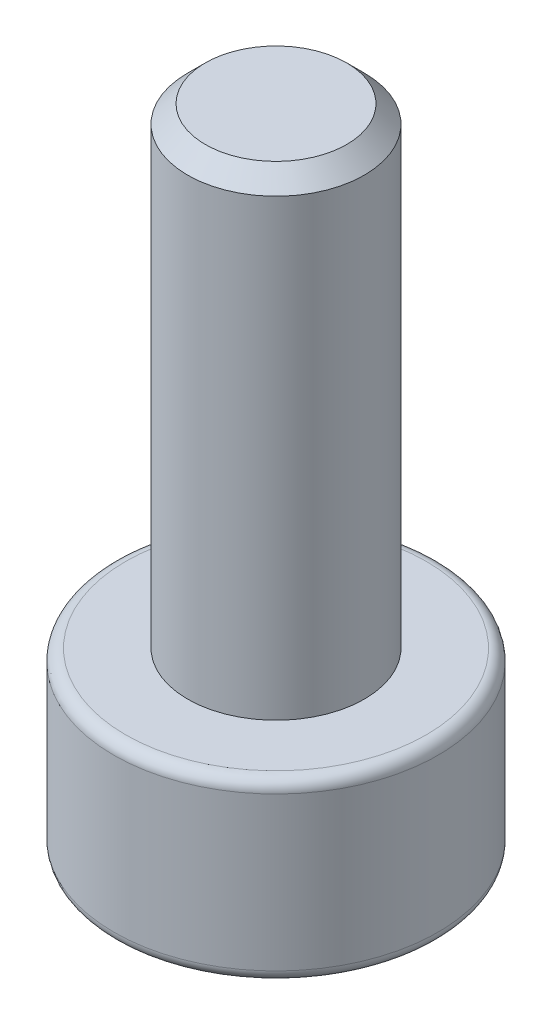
ISO-10303-21;
HEADER;
FILE_DESCRIPTION(('STEP AP214'),'2;1');
FILE_NAME('part.step','',(''),(''),'','','');
FILE_SCHEMA(('AUTOMOTIVE_DESIGN { 1 0 10303 214 1 1 1 1 }'));
ENDSEC;
DATA;
#1=APPLICATION_CONTEXT('core data for automotive mechanical design processes');
#2=APPLICATION_PROTOCOL_DEFINITION('international standard','automotive_design',2000,#1);
#3=PRODUCT_CONTEXT('',#1,'mechanical');
#4=PRODUCT('Part','Part','',(#3));
#5=PRODUCT_RELATED_PRODUCT_CATEGORY('part','',(#4));
#6=PRODUCT_DEFINITION_FORMATION('','',#4);
#7=PRODUCT_DEFINITION_CONTEXT('part definition',#1,'design');
#8=PRODUCT_DEFINITION('design','',#6,#7);
#9=PRODUCT_DEFINITION_SHAPE('','',#8);
#10=(LENGTH_UNIT() NAMED_UNIT(*) SI_UNIT(.MILLI.,.METRE.));
#11=(NAMED_UNIT(*) PLANE_ANGLE_UNIT() SI_UNIT($,.RADIAN.));
#12=(NAMED_UNIT(*) SI_UNIT($,.STERADIAN.) SOLID_ANGLE_UNIT());
#13=UNCERTAINTY_MEASURE_WITH_UNIT(LENGTH_MEASURE(1.E-05),#10,'distance_accuracy_value','');
#14=(GEOMETRIC_REPRESENTATION_CONTEXT(3) GLOBAL_UNCERTAINTY_ASSIGNED_CONTEXT((#13)) GLOBAL_UNIT_ASSIGNED_CONTEXT((#10,
#11,#12)) REPRESENTATION_CONTEXT('',''));
#15=CARTESIAN_POINT('',(0.,0.,0.));
#16=DIRECTION('',(0.,0.,1.));
#17=DIRECTION('',(1.,0.,0.));
#18=AXIS2_PLACEMENT_3D('',#15,#16,#17);
#19=CARTESIAN_POINT('',(-1.15470053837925,2.,0.));
#20=DIRECTION('',(-0.866025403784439,0.,-0.5));
#21=DIRECTION('',(-0.5,0.,0.866025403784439));
#22=AXIS2_PLACEMENT_3D('',#19,#20,#21);
#23=PLANE('',#22);
#24=DIRECTION('',(0.,1.,0.));
#25=VECTOR('',#24,1.);
#26=CARTESIAN_POINT('',(-0.577350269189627,2.,-1.));
#27=LINE('',#26,#25);
#28=CARTESIAN_POINT('',(-0.577350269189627,0.,-1.));
#29=VERTEX_POINT('',#28);
#30=CARTESIAN_POINT('',(-0.577350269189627,2.,-1.));
#31=VERTEX_POINT('',#30);
#32=EDGE_CURVE('E97',#29,#31,#27,.T.);
#33=ORIENTED_EDGE('',*,*,#32,.T.);
#34=DIRECTION('',(-0.5,0.,0.866025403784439));
#35=VECTOR('',#34,1.);
#36=CARTESIAN_POINT('',(-1.15470053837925,2.,0.));
#37=LINE('',#36,#35);
#38=CARTESIAN_POINT('',(-1.15470053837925,2.,0.));
#39=VERTEX_POINT('',#38);
#40=EDGE_CURVE('E86',#39,#31,#37,.F.);
#41=ORIENTED_EDGE('',*,*,#40,.F.);
#42=DIRECTION('',(0.,1.,0.));
#43=VECTOR('',#42,1.);
#44=CARTESIAN_POINT('',(-1.15470053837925,2.,0.));
#45=LINE('',#44,#43);
#46=CARTESIAN_POINT('',(-1.15470053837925,0.,0.));
#47=VERTEX_POINT('',#46);
#48=EDGE_CURVE('E106',#39,#47,#45,.F.);
#49=ORIENTED_EDGE('',*,*,#48,.T.);
#50=DIRECTION('',(-0.5,0.,0.866025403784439));
#51=VECTOR('',#50,1.);
#52=CARTESIAN_POINT('',(-1.15470053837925,0.,0.));
#53=LINE('',#52,#51);
#54=EDGE_CURVE('E81',#29,#47,#53,.T.);
#55=ORIENTED_EDGE('',*,*,#54,.F.);
#56=EDGE_LOOP('',(#33,#41,#49,#55));
#57=FACE_BOUND('',#56,.T.);
#58=ADVANCED_FACE('F17',(#57),#23,.F.);
#59=CARTESIAN_POINT('',(-0.577350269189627,2.,-1.));
#60=DIRECTION('',(0.,0.,-1.));
#61=DIRECTION('',(-1.,0.,0.));
#62=AXIS2_PLACEMENT_3D('',#59,#60,#61);
#63=PLANE('',#62);
#64=DIRECTION('',(0.,1.,0.));
#65=VECTOR('',#64,1.);
#66=CARTESIAN_POINT('',(0.577350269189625,2.,-1.));
#67=LINE('',#66,#65);
#68=CARTESIAN_POINT('',(0.577350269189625,0.,-1.));
#69=VERTEX_POINT('',#68);
#70=CARTESIAN_POINT('',(0.577350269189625,2.,-1.));
#71=VERTEX_POINT('',#70);
#72=EDGE_CURVE('E102',#69,#71,#67,.T.);
#73=ORIENTED_EDGE('',*,*,#72,.T.);
#74=DIRECTION('',(-1.,0.,0.));
#75=VECTOR('',#74,1.);
#76=CARTESIAN_POINT('',(-0.577350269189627,2.,-1.));
#77=LINE('',#76,#75);
#78=EDGE_CURVE('E90',#31,#71,#77,.F.);
#79=ORIENTED_EDGE('',*,*,#78,.F.);
#80=ORIENTED_EDGE('',*,*,#32,.F.);
#81=DIRECTION('',(-1.,0.,0.));
#82=VECTOR('',#81,1.);
#83=CARTESIAN_POINT('',(-0.577350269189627,0.,-1.));
#84=LINE('',#83,#82);
#85=EDGE_CURVE('E104',#69,#29,#84,.T.);
#86=ORIENTED_EDGE('',*,*,#85,.F.);
#87=EDGE_LOOP('',(#73,#79,#80,#86));
#88=FACE_BOUND('',#87,.T.);
#89=ADVANCED_FACE('F100',(#88),#63,.F.);
#90=CARTESIAN_POINT('',(-0.577350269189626,2.,1.));
#91=DIRECTION('',(-0.866025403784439,0.,0.5));
#92=DIRECTION('',(0.5,0.,0.866025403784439));
#93=AXIS2_PLACEMENT_3D('',#90,#91,#92);
#94=PLANE('',#93);
#95=ORIENTED_EDGE('',*,*,#48,.F.);
#96=DIRECTION('',(-0.5,0.,-0.866025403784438));
#97=VECTOR('',#96,1.);
#98=CARTESIAN_POINT('',(-0.577350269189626,2.,1.));
#99=LINE('',#98,#97);
#100=CARTESIAN_POINT('',(-0.577350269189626,2.,1.));
#101=VERTEX_POINT('',#100);
#102=EDGE_CURVE('E93',#101,#39,#99,.T.);
#103=ORIENTED_EDGE('',*,*,#102,.F.);
#104=DIRECTION('',(0.,1.,0.));
#105=VECTOR('',#104,1.);
#106=CARTESIAN_POINT('',(-0.577350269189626,2.,1.));
#107=LINE('',#106,#105);
#108=CARTESIAN_POINT('',(-0.577350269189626,0.,1.));
#109=VERTEX_POINT('',#108);
#110=EDGE_CURVE('E187',#101,#109,#107,.F.);
#111=ORIENTED_EDGE('',*,*,#110,.T.);
#112=DIRECTION('',(0.5,0.,0.866025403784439));
#113=VECTOR('',#112,1.);
#114=CARTESIAN_POINT('',(-0.577350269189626,0.,1.));
#115=LINE('',#114,#113);
#116=EDGE_CURVE('E199',#47,#109,#115,.T.);
#117=ORIENTED_EDGE('',*,*,#116,.F.);
#118=EDGE_LOOP('',(#95,#103,#111,#117));
#119=FACE_BOUND('',#118,.T.);
#120=ADVANCED_FACE('F202',(#119),#94,.F.);
#121=CARTESIAN_POINT('',(0.577350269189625,2.,-1.));
#122=DIRECTION('',(0.866025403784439,0.,-0.5));
#123=DIRECTION('',(-0.5,0.,-0.866025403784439));
#124=AXIS2_PLACEMENT_3D('',#121,#122,#123);
#125=PLANE('',#124);
#126=DIRECTION('',(0.,1.,0.));
#127=VECTOR('',#126,1.);
#128=CARTESIAN_POINT('',(1.15470053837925,2.,0.));
#129=LINE('',#128,#127);
#130=CARTESIAN_POINT('',(1.15470053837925,0.,0.));
#131=VERTEX_POINT('',#130);
#132=CARTESIAN_POINT('',(1.15470053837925,2.,0.));
#133=VERTEX_POINT('',#132);
#134=EDGE_CURVE('E183',#131,#133,#129,.T.);
#135=ORIENTED_EDGE('',*,*,#134,.T.);
#136=DIRECTION('',(0.5,0.,0.866025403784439));
#137=VECTOR('',#136,1.);
#138=CARTESIAN_POINT('',(0.577350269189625,2.,-1.));
#139=LINE('',#138,#137);
#140=EDGE_CURVE('E193',#71,#133,#139,.T.);
#141=ORIENTED_EDGE('',*,*,#140,.F.);
#142=ORIENTED_EDGE('',*,*,#72,.F.);
#143=DIRECTION('',(-0.5,0.,-0.866025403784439));
#144=VECTOR('',#143,1.);
#145=CARTESIAN_POINT('',(0.577350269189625,0.,-1.));
#146=LINE('',#145,#144);
#147=EDGE_CURVE('E195',#131,#69,#146,.T.);
#148=ORIENTED_EDGE('',*,*,#147,.F.);
#149=EDGE_LOOP('',(#135,#141,#142,#148));
#150=FACE_BOUND('',#149,.T.);
#151=ADVANCED_FACE('F210',(#150),#125,.F.);
#152=CARTESIAN_POINT('',(0.,2.,0.));
#153=DIRECTION('',(0.,-1.,0.));
#154=DIRECTION('',(0.,0.,-1.));
#155=AXIS2_PLACEMENT_3D('',#152,#153,#154);
#156=PLANE('',#155);
#157=ORIENTED_EDGE('',*,*,#40,.T.);
#158=ORIENTED_EDGE('',*,*,#78,.T.);
#159=ORIENTED_EDGE('',*,*,#140,.T.);
#160=DIRECTION('',(0.5,0.,-0.866025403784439));
#161=VECTOR('',#160,1.);
#162=CARTESIAN_POINT('',(1.15470053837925,2.,0.));
#163=LINE('',#162,#161);
#164=CARTESIAN_POINT('',(0.577350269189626,2.,1.));
#165=VERTEX_POINT('',#164);
#166=EDGE_CURVE('E181',#133,#165,#163,.F.);
#167=ORIENTED_EDGE('',*,*,#166,.T.);
#168=DIRECTION('',(1.,0.,0.));
#169=VECTOR('',#168,1.);
#170=CARTESIAN_POINT('',(0.577350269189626,2.,1.));
#171=LINE('',#170,#169);
#172=EDGE_CURVE('E190',#165,#101,#171,.F.);
#173=ORIENTED_EDGE('',*,*,#172,.T.);
#174=ORIENTED_EDGE('',*,*,#102,.T.);
#175=EDGE_LOOP('',(#157,#158,#159,#167,#173,#174));
#176=FACE_BOUND('',#175,.T.);
#177=ADVANCED_FACE('F87',(#176),#156,.T.);
#178=CARTESIAN_POINT('',(0.577350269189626,2.,1.));
#179=DIRECTION('',(0.,0.,1.));
#180=DIRECTION('',(1.,0.,0.));
#181=AXIS2_PLACEMENT_3D('',#178,#179,#180);
#182=PLANE('',#181);
#183=ORIENTED_EDGE('',*,*,#110,.F.);
#184=ORIENTED_EDGE('',*,*,#172,.F.);
#185=DIRECTION('',(0.,1.,0.));
#186=VECTOR('',#185,1.);
#187=CARTESIAN_POINT('',(0.577350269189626,2.,1.));
#188=LINE('',#187,#186);
#189=CARTESIAN_POINT('',(0.577350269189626,0.,1.));
#190=VERTEX_POINT('',#189);
#191=EDGE_CURVE('E172',#165,#190,#188,.F.);
#192=ORIENTED_EDGE('',*,*,#191,.T.);
#193=DIRECTION('',(1.,0.,0.));
#194=VECTOR('',#193,1.);
#195=CARTESIAN_POINT('',(0.577350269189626,0.,1.));
#196=LINE('',#195,#194);
#197=EDGE_CURVE('E185',#109,#190,#196,.T.);
#198=ORIENTED_EDGE('',*,*,#197,.F.);
#199=EDGE_LOOP('',(#183,#184,#192,#198));
#200=FACE_BOUND('',#199,.T.);
#201=ADVANCED_FACE('F217',(#200),#182,.F.);
#202=CARTESIAN_POINT('',(1.15470053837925,2.,0.));
#203=DIRECTION('',(0.866025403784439,0.,0.5));
#204=DIRECTION('',(0.5,0.,-0.866025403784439));
#205=AXIS2_PLACEMENT_3D('',#202,#203,#204);
#206=PLANE('',#205);
#207=ORIENTED_EDGE('',*,*,#191,.F.);
#208=ORIENTED_EDGE('',*,*,#166,.F.);
#209=ORIENTED_EDGE('',*,*,#134,.F.);
#210=DIRECTION('',(-0.5,0.,0.866025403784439));
#211=VECTOR('',#210,1.);
#212=CARTESIAN_POINT('',(1.15470053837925,0.,0.));
#213=LINE('',#212,#211);
#214=EDGE_CURVE('E180',#131,#190,#213,.T.);
#215=ORIENTED_EDGE('',*,*,#214,.T.);
#216=EDGE_LOOP('',(#207,#208,#209,#215));
#217=FACE_BOUND('',#216,.T.);
#218=ADVANCED_FACE('F215',(#217),#206,.F.);
#219=CARTESIAN_POINT('',(0.,0.,0.));
#220=DIRECTION('',(0.,1.,0.));
#221=DIRECTION('',(0.,0.,1.));
#222=AXIS2_PLACEMENT_3D('',#219,#220,#221);
#223=PLANE('',#222);
#224=CARTESIAN_POINT('',(0.,0.,0.));
#225=DIRECTION('',(0.,1.,0.));
#226=DIRECTION('',(0.,0.,1.));
#227=AXIS2_PLACEMENT_3D('',#224,#225,#226);
#228=CIRCLE('',#227,2.55);
#229=CARTESIAN_POINT('',(0.,0.,2.55));
#230=VERTEX_POINT('',#229);
#231=CARTESIAN_POINT('',(0.,0.,-2.55));
#232=VERTEX_POINT('',#231);
#233=EDGE_CURVE('E271',#230,#232,#228,.T.);
#234=ORIENTED_EDGE('',*,*,#233,.F.);
#235=CARTESIAN_POINT('',(0.,0.,0.));
#236=DIRECTION('',(0.,1.,0.));
#237=DIRECTION('',(0.,0.,-1.));
#238=AXIS2_PLACEMENT_3D('',#235,#236,#237);
#239=CIRCLE('',#238,2.55);
#240=EDGE_CURVE('E270',#232,#230,#239,.T.);
#241=ORIENTED_EDGE('',*,*,#240,.F.);
#242=EDGE_LOOP('',(#234,#241));
#243=FACE_BOUND('',#242,.T.);
#244=ORIENTED_EDGE('',*,*,#147,.T.);
#245=ORIENTED_EDGE('',*,*,#85,.T.);
#246=ORIENTED_EDGE('',*,*,#54,.T.);
#247=ORIENTED_EDGE('',*,*,#116,.T.);
#248=ORIENTED_EDGE('',*,*,#197,.T.);
#249=ORIENTED_EDGE('',*,*,#214,.F.);
#250=EDGE_LOOP('',(#244,#245,#246,#247,#248,#249));
#251=FACE_BOUND('',#250,.T.);
#252=ADVANCED_FACE('F160',(#243,#251),#223,.F.);
#253=CARTESIAN_POINT('',(0.,0.2,0.));
#254=DIRECTION('',(0.,1.,0.));
#255=DIRECTION('',(0.,0.,1.));
#256=AXIS2_PLACEMENT_3D('',#253,#254,#255);
#257=TOROIDAL_SURFACE('',#256,2.55,0.2);
#258=ORIENTED_EDGE('',*,*,#233,.T.);
#259=ORIENTED_EDGE('',*,*,#240,.T.);
#260=EDGE_LOOP('',(#258,#259));
#261=FACE_BOUND('',#260,.T.);
#262=CARTESIAN_POINT('',(0.,0.2,0.));
#263=DIRECTION('',(0.,-1.,0.));
#264=DIRECTION('',(0.,0.,-1.));
#265=AXIS2_PLACEMENT_3D('',#262,#263,#264);
#266=CIRCLE('',#265,2.75);
#267=CARTESIAN_POINT('',(0.,0.2,-2.75));
#268=VERTEX_POINT('',#267);
#269=EDGE_CURVE('E151',#268,#268,#266,.F.);
#270=ORIENTED_EDGE('',*,*,#269,.F.);
#271=EDGE_LOOP('',(#270));
#272=FACE_BOUND('',#271,.T.);
#273=ADVANCED_FACE('F155',(#261,#272),#257,.T.);
#274=CARTESIAN_POINT('',(0.,3.,0.));
#275=DIRECTION('',(0.,-1.,0.));
#276=DIRECTION('',(0.,0.,-1.));
#277=AXIS2_PLACEMENT_3D('',#274,#275,#276);
#278=CYLINDRICAL_SURFACE('',#277,2.75);
#279=CARTESIAN_POINT('',(0.,2.8,0.));
#280=DIRECTION('',(0.,1.,0.));
#281=DIRECTION('',(0.,0.,1.));
#282=AXIS2_PLACEMENT_3D('',#279,#280,#281);
#283=CIRCLE('',#282,2.75);
#284=CARTESIAN_POINT('',(0.,2.8,2.75));
#285=VERTEX_POINT('',#284);
#286=EDGE_CURVE('E115',#285,#285,#283,.T.);
#287=ORIENTED_EDGE('',*,*,#286,.F.);
#288=EDGE_LOOP('',(#287));
#289=FACE_BOUND('',#288,.T.);
#290=ORIENTED_EDGE('',*,*,#269,.T.);
#291=EDGE_LOOP('',(#290));
#292=FACE_BOUND('',#291,.T.);
#293=ADVANCED_FACE('F159',(#289,#292),#278,.T.);
#294=CARTESIAN_POINT('',(0.,11.,0.));
#295=DIRECTION('',(0.,1.,0.));
#296=DIRECTION('',(0.,0.,1.));
#297=AXIS2_PLACEMENT_3D('',#294,#295,#296);
#298=PLANE('',#297);
#299=CARTESIAN_POINT('',(0.,11.0000000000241,0.));
#300=DIRECTION('',(0.,-1.,0.));
#301=DIRECTION('',(0.,0.,-1.));
#302=AXIS2_PLACEMENT_3D('',#299,#300,#301);
#303=CIRCLE('',#302,1.19999999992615);
#304=CARTESIAN_POINT('',(0.,11.0000000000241,-1.19999999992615));
#305=VERTEX_POINT('',#304);
#306=EDGE_CURVE('E111',#305,#305,#303,.T.);
#307=ORIENTED_EDGE('',*,*,#306,.F.);
#308=EDGE_LOOP('',(#307));
#309=FACE_BOUND('',#308,.T.);
#310=ADVANCED_FACE('F132',(#309),#298,.T.);
#311=CARTESIAN_POINT('',(0.,2.8,0.));
#312=DIRECTION('',(0.,1.,0.));
#313=DIRECTION('',(0.,0.,1.));
#314=AXIS2_PLACEMENT_3D('',#311,#312,#313);
#315=TOROIDAL_SURFACE('',#314,2.55,0.2);
#316=ORIENTED_EDGE('',*,*,#286,.T.);
#317=EDGE_LOOP('',(#316));
#318=FACE_BOUND('',#317,.T.);
#319=CARTESIAN_POINT('',(0.,3.,0.));
#320=DIRECTION('',(0.,-1.,0.));
#321=DIRECTION('',(0.,0.,1.));
#322=AXIS2_PLACEMENT_3D('',#319,#320,#321);
#323=CIRCLE('',#322,2.55);
#324=CARTESIAN_POINT('',(0.,3.,-2.55));
#325=VERTEX_POINT('',#324);
#326=CARTESIAN_POINT('',(0.,3.,2.55));
#327=VERTEX_POINT('',#326);
#328=EDGE_CURVE('E36',#325,#327,#323,.F.);
#329=ORIENTED_EDGE('',*,*,#328,.F.);
#330=CARTESIAN_POINT('',(0.,3.,0.));
#331=DIRECTION('',(0.,-1.,0.));
#332=DIRECTION('',(0.,0.,-1.));
#333=AXIS2_PLACEMENT_3D('',#330,#331,#332);
#334=CIRCLE('',#333,2.55);
#335=EDGE_CURVE('E114',#327,#325,#334,.F.);
#336=ORIENTED_EDGE('',*,*,#335,.F.);
#337=EDGE_LOOP('',(#329,#336));
#338=FACE_BOUND('',#337,.T.);
#339=ADVANCED_FACE('F120',(#318,#338),#315,.T.);
#340=CARTESIAN_POINT('',(0.,10.7000000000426,0.));
#341=DIRECTION('',(0.,-1.,0.));
#342=DIRECTION('',(0.,0.,-1.));
#343=AXIS2_PLACEMENT_3D('',#340,#341,#342);
#344=CONICAL_SURFACE('',#343,1.49999999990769,0.785398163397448);
#345=CARTESIAN_POINT('',(0.,10.7,0.));
#346=DIRECTION('',(0.,-1.,0.));
#347=DIRECTION('',(0.,0.,-1.));
#348=AXIS2_PLACEMENT_3D('',#345,#346,#347);
#349=CIRCLE('',#348,1.5);
#350=CARTESIAN_POINT('',(0.,10.7,-1.5));
#351=VERTEX_POINT('',#350);
#352=EDGE_CURVE('E28',#351,#351,#349,.T.);
#353=ORIENTED_EDGE('',*,*,#352,.F.);
#354=EDGE_LOOP('',(#353));
#355=FACE_BOUND('',#354,.T.);
#356=ORIENTED_EDGE('',*,*,#306,.T.);
#357=EDGE_LOOP('',(#356));
#358=FACE_BOUND('',#357,.T.);
#359=ADVANCED_FACE('F131',(#355,#358),#344,.T.);
#360=CARTESIAN_POINT('',(0.,3.,0.));
#361=DIRECTION('',(0.,1.,0.));
#362=DIRECTION('',(0.,0.,1.));
#363=AXIS2_PLACEMENT_3D('',#360,#361,#362);
#364=PLANE('',#363);
#365=CARTESIAN_POINT('',(0.,3.,0.));
#366=DIRECTION('',(0.,-1.,0.));
#367=DIRECTION('',(0.,0.,-1.));
#368=AXIS2_PLACEMENT_3D('',#365,#366,#367);
#369=CIRCLE('',#368,1.5);
#370=CARTESIAN_POINT('',(0.,3.,-1.5));
#371=VERTEX_POINT('',#370);
#372=EDGE_CURVE('E11',#371,#371,#369,.F.);
#373=ORIENTED_EDGE('',*,*,#372,.F.);
#374=EDGE_LOOP('',(#373));
#375=FACE_BOUND('',#374,.T.);
#376=ORIENTED_EDGE('',*,*,#335,.T.);
#377=ORIENTED_EDGE('',*,*,#328,.T.);
#378=EDGE_LOOP('',(#376,#377));
#379=FACE_BOUND('',#378,.T.);
#380=ADVANCED_FACE('F228',(#375,#379),#364,.T.);
#381=CARTESIAN_POINT('',(0.,11.,0.));
#382=DIRECTION('',(0.,-1.,0.));
#383=DIRECTION('',(0.,0.,-1.));
#384=AXIS2_PLACEMENT_3D('',#381,#382,#383);
#385=CYLINDRICAL_SURFACE('',#384,1.5);
#386=ORIENTED_EDGE('',*,*,#372,.T.);
#387=EDGE_LOOP('',(#386));
#388=FACE_BOUND('',#387,.T.);
#389=ORIENTED_EDGE('',*,*,#352,.T.);
#390=EDGE_LOOP('',(#389));
#391=FACE_BOUND('',#390,.T.);
#392=ADVANCED_FACE('F226',(#388,#391),#385,.T.);
#393=CLOSED_SHELL('',(#58,#89,#120,#151,#177,#201,#218,#252,#273,#293,#310,#339,#359,#380,#392));
#394=MANIFOLD_SOLID_BREP('B1',#393);
#395=ADVANCED_BREP_SHAPE_REPRESENTATION('',(#18,#394),#14);
#396=SHAPE_DEFINITION_REPRESENTATION(#9,#395);
ENDSEC;
END-ISO-10303-21;
